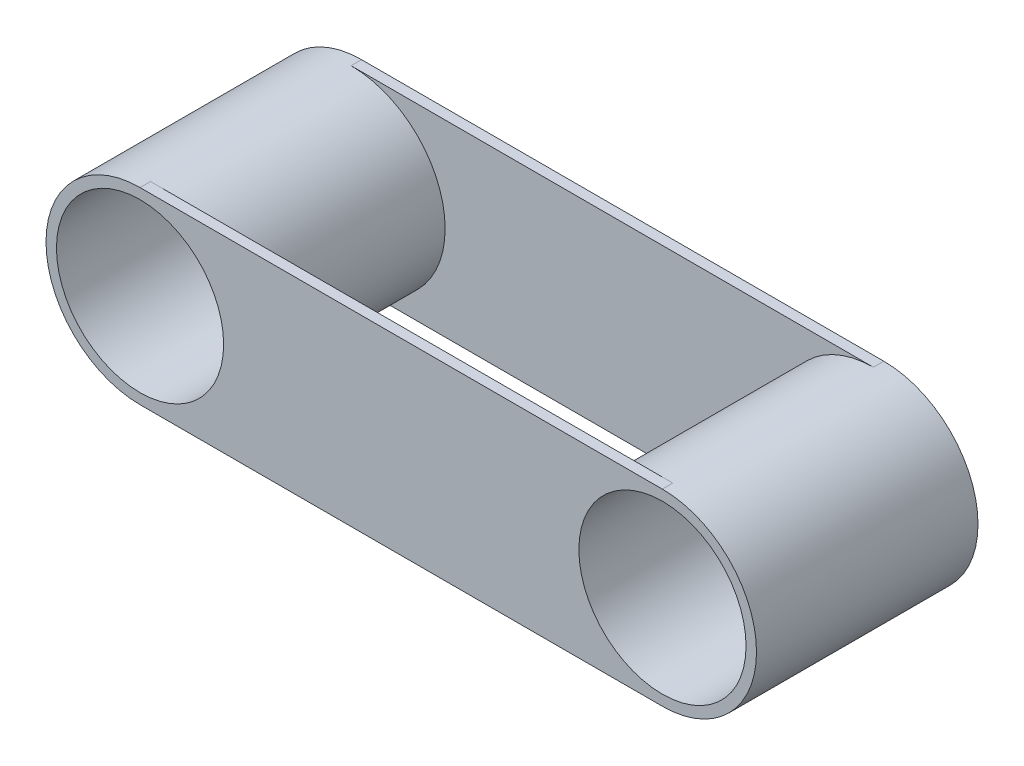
ISO-10303-21;
HEADER;
FILE_DESCRIPTION(('STEP AP214'),'2;1');
FILE_NAME('part.step','',(''),(''),'','','');
FILE_SCHEMA(('AUTOMOTIVE_DESIGN { 1 0 10303 214 1 1 1 1 }'));
ENDSEC;
DATA;
#1=APPLICATION_CONTEXT('core data for automotive mechanical design processes');
#2=APPLICATION_PROTOCOL_DEFINITION('international standard','automotive_design',2000,#1);
#3=PRODUCT_CONTEXT('',#1,'mechanical');
#4=PRODUCT('Part','Part','',(#3));
#5=PRODUCT_RELATED_PRODUCT_CATEGORY('part','',(#4));
#6=PRODUCT_DEFINITION_FORMATION('','',#4);
#7=PRODUCT_DEFINITION_CONTEXT('part definition',#1,'design');
#8=PRODUCT_DEFINITION('design','',#6,#7);
#9=PRODUCT_DEFINITION_SHAPE('','',#8);
#10=(LENGTH_UNIT() NAMED_UNIT(*) SI_UNIT(.MILLI.,.METRE.));
#11=(NAMED_UNIT(*) PLANE_ANGLE_UNIT() SI_UNIT($,.RADIAN.));
#12=(NAMED_UNIT(*) SI_UNIT($,.STERADIAN.) SOLID_ANGLE_UNIT());
#13=UNCERTAINTY_MEASURE_WITH_UNIT(LENGTH_MEASURE(1.E-05),#10,'distance_accuracy_value','');
#14=(GEOMETRIC_REPRESENTATION_CONTEXT(3) GLOBAL_UNCERTAINTY_ASSIGNED_CONTEXT((#13)) GLOBAL_UNIT_ASSIGNED_CONTEXT((#10,
#11,#12)) REPRESENTATION_CONTEXT('',''));
#15=CARTESIAN_POINT('',(0.,0.,0.));
#16=DIRECTION('',(0.,0.,1.));
#17=DIRECTION('',(1.,0.,0.));
#18=AXIS2_PLACEMENT_3D('',#15,#16,#17);
#19=CARTESIAN_POINT('',(499.88,90.,96.));
#20=DIRECTION('',(-1.,0.,0.));
#21=DIRECTION('',(0.,0.,1.));
#22=AXIS2_PLACEMENT_3D('',#19,#20,#21);
#23=PLANE('',#22);
#24=DIRECTION('',(0.,-1.,0.));
#25=VECTOR('',#24,1.);
#26=CARTESIAN_POINT('',(499.88,90.,106.));
#27=LINE('',#26,#25);
#28=CARTESIAN_POINT('',(499.88,90.,106.));
#29=VERTEX_POINT('',#28);
#30=CARTESIAN_POINT('',(499.88,89.9999199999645,106.));
#31=VERTEX_POINT('',#30);
#32=EDGE_CURVE('E60',#29,#31,#27,.T.);
#33=ORIENTED_EDGE('',*,*,#32,.T.);
#34=DIRECTION('',(0.,0.,-1.));
#35=VECTOR('',#34,1.);
#36=CARTESIAN_POINT('',(499.88,89.9999199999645,106.));
#37=LINE('',#36,#35);
#38=CARTESIAN_POINT('',(499.88,89.9999199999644,96.));
#39=VERTEX_POINT('',#38);
#40=EDGE_CURVE('E165',#31,#39,#37,.T.);
#41=ORIENTED_EDGE('',*,*,#40,.T.);
#42=DIRECTION('',(0.,-1.,0.));
#43=VECTOR('',#42,1.);
#44=CARTESIAN_POINT('',(499.88,90.,96.));
#45=LINE('',#44,#43);
#46=CARTESIAN_POINT('',(499.88,90.,96.));
#47=VERTEX_POINT('',#46);
#48=EDGE_CURVE('E183',#47,#39,#45,.T.);
#49=ORIENTED_EDGE('',*,*,#48,.F.);
#50=DIRECTION('',(0.,0.,1.));
#51=VECTOR('',#50,1.);
#52=CARTESIAN_POINT('',(499.88,90.,96.));
#53=LINE('',#52,#51);
#54=EDGE_CURVE('E198',#47,#29,#53,.T.);
#55=ORIENTED_EDGE('',*,*,#54,.T.);
#56=EDGE_LOOP('',(#33,#41,#49,#55));
#57=FACE_BOUND('',#56,.T.);
#58=ADVANCED_FACE('F37',(#57),#23,.F.);
#59=CARTESIAN_POINT('',(499.88,90.,-96.));
#60=DIRECTION('',(1.,0.,0.));
#61=DIRECTION('',(0.,0.,-1.));
#62=AXIS2_PLACEMENT_3D('',#59,#60,#61);
#63=PLANE('',#62);
#64=DIRECTION('',(0.,0.,-1.));
#65=VECTOR('',#64,1.);
#66=CARTESIAN_POINT('',(499.88,-89.9999199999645,106.));
#67=LINE('',#66,#65);
#68=CARTESIAN_POINT('',(499.88,-89.9999199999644,-96.));
#69=VERTEX_POINT('',#68);
#70=CARTESIAN_POINT('',(499.88,-89.9999199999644,-106.));
#71=VERTEX_POINT('',#70);
#72=EDGE_CURVE('E133',#69,#71,#67,.T.);
#73=ORIENTED_EDGE('',*,*,#72,.F.);
#74=DIRECTION('',(0.,-1.,0.));
#75=VECTOR('',#74,1.);
#76=CARTESIAN_POINT('',(499.88,90.,-96.));
#77=LINE('',#76,#75);
#78=CARTESIAN_POINT('',(499.88,-90.,-96.));
#79=VERTEX_POINT('',#78);
#80=EDGE_CURVE('E127',#69,#79,#77,.T.);
#81=ORIENTED_EDGE('',*,*,#80,.T.);
#82=DIRECTION('',(0.,0.,-1.));
#83=VECTOR('',#82,1.);
#84=CARTESIAN_POINT('',(499.88,-90.,-96.));
#85=LINE('',#84,#83);
#86=CARTESIAN_POINT('',(499.88,-90.,-106.));
#87=VERTEX_POINT('',#86);
#88=EDGE_CURVE('E130',#79,#87,#85,.T.);
#89=ORIENTED_EDGE('',*,*,#88,.T.);
#90=DIRECTION('',(0.,-1.,0.));
#91=VECTOR('',#90,1.);
#92=CARTESIAN_POINT('',(499.88,90.,-106.));
#93=LINE('',#92,#91);
#94=EDGE_CURVE('E164',#71,#87,#93,.T.);
#95=ORIENTED_EDGE('',*,*,#94,.F.);
#96=EDGE_LOOP('',(#73,#81,#89,#95));
#97=FACE_BOUND('',#96,.T.);
#98=ADVANCED_FACE('F129',(#97),#63,.T.);
#99=CARTESIAN_POINT('',(0.,0.,106.));
#100=DIRECTION('',(0.,0.,-1.));
#101=DIRECTION('',(-1.,0.,0.));
#102=AXIS2_PLACEMENT_3D('',#99,#100,#101);
#103=CYLINDRICAL_SURFACE('',#102,90.);
#104=CARTESIAN_POINT('',(0.,0.,106.));
#105=DIRECTION('',(0.,0.,1.));
#106=DIRECTION('',(1.,0.,0.));
#107=AXIS2_PLACEMENT_3D('',#104,#105,#106);
#108=CIRCLE('',#107,90.);
#109=CARTESIAN_POINT('',(0.,90.,106.));
#110=VERTEX_POINT('',#109);
#111=CARTESIAN_POINT('',(0.,-90.,106.));
#112=VERTEX_POINT('',#111);
#113=EDGE_CURVE('E45',#110,#112,#108,.T.);
#114=ORIENTED_EDGE('',*,*,#113,.F.);
#115=DIRECTION('',(0.,0.,1.));
#116=VECTOR('',#115,1.);
#117=CARTESIAN_POINT('',(0.,90.,96.));
#118=LINE('',#117,#116);
#119=CARTESIAN_POINT('',(0.,90.,96.));
#120=VERTEX_POINT('',#119);
#121=EDGE_CURVE('E200',#120,#110,#118,.T.);
#122=ORIENTED_EDGE('',*,*,#121,.F.);
#123=CARTESIAN_POINT('',(0.,0.,96.));
#124=DIRECTION('',(0.,0.,1.));
#125=DIRECTION('',(1.,0.,0.));
#126=AXIS2_PLACEMENT_3D('',#123,#124,#125);
#127=CIRCLE('',#126,90.);
#128=CARTESIAN_POINT('',(0.,-90.,96.));
#129=VERTEX_POINT('',#128);
#130=EDGE_CURVE('E176',#129,#120,#127,.T.);
#131=ORIENTED_EDGE('',*,*,#130,.F.);
#132=DIRECTION('',(0.,0.,1.));
#133=VECTOR('',#132,1.);
#134=CARTESIAN_POINT('',(0.,-90.,96.));
#135=LINE('',#134,#133);
#136=EDGE_CURVE('E188',#129,#112,#135,.T.);
#137=ORIENTED_EDGE('',*,*,#136,.T.);
#138=EDGE_LOOP('',(#114,#122,#131,#137));
#139=FACE_BOUND('',#138,.T.);
#140=DIRECTION('',(0.,0.,-1.));
#141=VECTOR('',#140,1.);
#142=CARTESIAN_POINT('',(0.,-90.,-96.));
#143=LINE('',#142,#141);
#144=CARTESIAN_POINT('',(0.,-90.,-96.));
#145=VERTEX_POINT('',#144);
#146=CARTESIAN_POINT('',(0.,-90.,-106.));
#147=VERTEX_POINT('',#146);
#148=EDGE_CURVE('E146',#145,#147,#143,.T.);
#149=ORIENTED_EDGE('',*,*,#148,.F.);
#150=CARTESIAN_POINT('',(0.,0.,-96.));
#151=DIRECTION('',(0.,0.,1.));
#152=DIRECTION('',(1.,0.,0.));
#153=AXIS2_PLACEMENT_3D('',#150,#151,#152);
#154=CIRCLE('',#153,90.);
#155=CARTESIAN_POINT('',(0.,90.,-96.));
#156=VERTEX_POINT('',#155);
#157=EDGE_CURVE('E152',#145,#156,#154,.T.);
#158=ORIENTED_EDGE('',*,*,#157,.T.);
#159=DIRECTION('',(0.,0.,-1.));
#160=VECTOR('',#159,1.);
#161=CARTESIAN_POINT('',(0.,90.,-96.));
#162=LINE('',#161,#160);
#163=CARTESIAN_POINT('',(0.,90.,-106.));
#164=VERTEX_POINT('',#163);
#165=EDGE_CURVE('E162',#156,#164,#162,.T.);
#166=ORIENTED_EDGE('',*,*,#165,.T.);
#167=CARTESIAN_POINT('',(0.,0.,-106.));
#168=DIRECTION('',(0.,0.,1.));
#169=DIRECTION('',(1.,0.,0.));
#170=AXIS2_PLACEMENT_3D('',#167,#168,#169);
#171=CIRCLE('',#170,90.);
#172=EDGE_CURVE('E206',#164,#147,#171,.T.);
#173=ORIENTED_EDGE('',*,*,#172,.T.);
#174=EDGE_LOOP('',(#149,#158,#166,#173));
#175=FACE_BOUND('',#174,.T.);
#176=ADVANCED_FACE('F39',(#139,#175),#103,.T.);
#177=CARTESIAN_POINT('',(0.,0.,106.));
#178=DIRECTION('',(0.,0.,1.));
#179=DIRECTION('',(1.,0.,0.));
#180=AXIS2_PLACEMENT_3D('',#177,#178,#179);
#181=PLANE('',#180);
#182=CARTESIAN_POINT('',(500.,0.,106.));
#183=DIRECTION('',(0.,0.,-1.));
#184=DIRECTION('',(-1.,0.,0.));
#185=AXIS2_PLACEMENT_3D('',#182,#183,#184);
#186=CIRCLE('',#185,80.);
#187=CARTESIAN_POINT('',(420.,0.,106.));
#188=VERTEX_POINT('',#187);
#189=EDGE_CURVE('E240',#188,#188,#186,.T.);
#190=ORIENTED_EDGE('',*,*,#189,.T.);
#191=EDGE_LOOP('',(#190));
#192=FACE_BOUND('',#191,.T.);
#193=CARTESIAN_POINT('',(499.88,-89.9999199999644,106.));
#194=VERTEX_POINT('',#193);
#195=CARTESIAN_POINT('',(499.88,-90.,106.));
#196=VERTEX_POINT('',#195);
#197=EDGE_CURVE('E190',#194,#196,#27,.T.);
#198=ORIENTED_EDGE('',*,*,#197,.F.);
#199=CARTESIAN_POINT('',(500.,0.,106.));
#200=DIRECTION('',(0.,0.,-1.));
#201=DIRECTION('',(-1.,0.,0.));
#202=AXIS2_PLACEMENT_3D('',#199,#200,#201);
#203=CIRCLE('',#202,90.);
#204=EDGE_CURVE('E227',#31,#194,#203,.T.);
#205=ORIENTED_EDGE('',*,*,#204,.F.);
#206=ORIENTED_EDGE('',*,*,#32,.F.);
#207=DIRECTION('',(1.,0.,0.));
#208=VECTOR('',#207,1.);
#209=CARTESIAN_POINT('',(0.,90.,106.));
#210=LINE('',#209,#208);
#211=EDGE_CURVE('E175',#110,#29,#210,.T.);
#212=ORIENTED_EDGE('',*,*,#211,.F.);
#213=ORIENTED_EDGE('',*,*,#113,.T.);
#214=DIRECTION('',(-1.,0.,0.));
#215=VECTOR('',#214,1.);
#216=CARTESIAN_POINT('',(499.88,-90.,106.));
#217=LINE('',#216,#215);
#218=EDGE_CURVE('E180',#196,#112,#217,.T.);
#219=ORIENTED_EDGE('',*,*,#218,.F.);
#220=EDGE_LOOP('',(#198,#205,#206,#212,#213,#219));
#221=FACE_BOUND('',#220,.T.);
#222=CARTESIAN_POINT('',(0.,0.,106.));
#223=DIRECTION('',(0.,0.,1.));
#224=DIRECTION('',(1.,0.,0.));
#225=AXIS2_PLACEMENT_3D('',#222,#223,#224);
#226=CIRCLE('',#225,80.);
#227=CARTESIAN_POINT('',(80.,0.,106.));
#228=VERTEX_POINT('',#227);
#229=EDGE_CURVE('E203',#228,#228,#226,.T.);
#230=ORIENTED_EDGE('',*,*,#229,.F.);
#231=EDGE_LOOP('',(#230));
#232=FACE_BOUND('',#231,.T.);
#233=ADVANCED_FACE('F248',(#192,#221,#232),#181,.T.);
#234=CARTESIAN_POINT('',(0.,0.,-106.));
#235=DIRECTION('',(0.,0.,1.));
#236=DIRECTION('',(1.,0.,0.));
#237=AXIS2_PLACEMENT_3D('',#234,#235,#236);
#238=PLANE('',#237);
#239=CARTESIAN_POINT('',(499.88,90.,-106.));
#240=VERTEX_POINT('',#239);
#241=CARTESIAN_POINT('',(499.88,89.9999199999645,-106.));
#242=VERTEX_POINT('',#241);
#243=EDGE_CURVE('E166',#240,#242,#93,.T.);
#244=ORIENTED_EDGE('',*,*,#243,.T.);
#245=CARTESIAN_POINT('',(500.,0.,-106.));
#246=DIRECTION('',(0.,0.,-1.));
#247=DIRECTION('',(-1.,0.,0.));
#248=AXIS2_PLACEMENT_3D('',#245,#246,#247);
#249=CIRCLE('',#248,90.);
#250=EDGE_CURVE('E218',#242,#71,#249,.T.);
#251=ORIENTED_EDGE('',*,*,#250,.T.);
#252=ORIENTED_EDGE('',*,*,#94,.T.);
#253=DIRECTION('',(-1.,0.,0.));
#254=VECTOR('',#253,1.);
#255=CARTESIAN_POINT('',(499.88,-90.,-106.));
#256=LINE('',#255,#254);
#257=EDGE_CURVE('E145',#87,#147,#256,.T.);
#258=ORIENTED_EDGE('',*,*,#257,.T.);
#259=ORIENTED_EDGE('',*,*,#172,.F.);
#260=DIRECTION('',(1.,0.,0.));
#261=VECTOR('',#260,1.);
#262=CARTESIAN_POINT('',(0.,90.,-106.));
#263=LINE('',#262,#261);
#264=EDGE_CURVE('E154',#164,#240,#263,.T.);
#265=ORIENTED_EDGE('',*,*,#264,.T.);
#266=EDGE_LOOP('',(#244,#251,#252,#258,#259,#265));
#267=FACE_BOUND('',#266,.T.);
#268=CARTESIAN_POINT('',(0.,0.,-106.));
#269=DIRECTION('',(0.,0.,1.));
#270=DIRECTION('',(1.,0.,0.));
#271=AXIS2_PLACEMENT_3D('',#268,#269,#270);
#272=CIRCLE('',#271,80.);
#273=CARTESIAN_POINT('',(80.,0.,-106.));
#274=VERTEX_POINT('',#273);
#275=EDGE_CURVE('E202',#274,#274,#272,.T.);
#276=ORIENTED_EDGE('',*,*,#275,.T.);
#277=EDGE_LOOP('',(#276));
#278=FACE_BOUND('',#277,.T.);
#279=CARTESIAN_POINT('',(500.,0.,-106.));
#280=DIRECTION('',(0.,0.,-1.));
#281=DIRECTION('',(-1.,0.,0.));
#282=AXIS2_PLACEMENT_3D('',#279,#280,#281);
#283=CIRCLE('',#282,80.);
#284=CARTESIAN_POINT('',(420.,0.,-106.));
#285=VERTEX_POINT('',#284);
#286=EDGE_CURVE('E242',#285,#285,#283,.T.);
#287=ORIENTED_EDGE('',*,*,#286,.F.);
#288=EDGE_LOOP('',(#287));
#289=FACE_BOUND('',#288,.T.);
#290=ADVANCED_FACE('F214',(#267,#278,#289),#238,.F.);
#291=CARTESIAN_POINT('',(0.,0.,106.));
#292=DIRECTION('',(0.,0.,-1.));
#293=DIRECTION('',(-1.,0.,0.));
#294=AXIS2_PLACEMENT_3D('',#291,#292,#293);
#295=CYLINDRICAL_SURFACE('',#294,80.);
#296=ORIENTED_EDGE('',*,*,#229,.T.);
#297=EDGE_LOOP('',(#296));
#298=FACE_BOUND('',#297,.T.);
#299=ORIENTED_EDGE('',*,*,#275,.F.);
#300=EDGE_LOOP('',(#299));
#301=FACE_BOUND('',#300,.T.);
#302=ADVANCED_FACE('F276',(#298,#301),#295,.F.);
#303=CARTESIAN_POINT('',(0.,90.,96.));
#304=DIRECTION('',(0.,-1.,0.));
#305=DIRECTION('',(0.,0.,-1.));
#306=AXIS2_PLACEMENT_3D('',#303,#304,#305);
#307=PLANE('',#306);
#308=ORIENTED_EDGE('',*,*,#211,.T.);
#309=ORIENTED_EDGE('',*,*,#54,.F.);
#310=DIRECTION('',(1.,0.,0.));
#311=VECTOR('',#310,1.);
#312=CARTESIAN_POINT('',(0.,90.,96.));
#313=LINE('',#312,#311);
#314=EDGE_CURVE('E179',#120,#47,#313,.T.);
#315=ORIENTED_EDGE('',*,*,#314,.F.);
#316=ORIENTED_EDGE('',*,*,#121,.T.);
#317=EDGE_LOOP('',(#308,#309,#315,#316));
#318=FACE_BOUND('',#317,.T.);
#319=ADVANCED_FACE('F270',(#318),#307,.F.);
#320=CARTESIAN_POINT('',(499.88,-89.9999199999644,96.));
#321=VERTEX_POINT('',#320);
#322=CARTESIAN_POINT('',(499.88,-90.,96.));
#323=VERTEX_POINT('',#322);
#324=EDGE_CURVE('E182',#321,#323,#45,.T.);
#325=ORIENTED_EDGE('',*,*,#324,.F.);
#326=DIRECTION('',(0.,0.,-1.));
#327=VECTOR('',#326,1.);
#328=CARTESIAN_POINT('',(499.88,-89.9999199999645,106.));
#329=LINE('',#328,#327);
#330=EDGE_CURVE('E52',#321,#194,#329,.F.);
#331=ORIENTED_EDGE('',*,*,#330,.T.);
#332=ORIENTED_EDGE('',*,*,#197,.T.);
#333=DIRECTION('',(0.,0.,1.));
#334=VECTOR('',#333,1.);
#335=CARTESIAN_POINT('',(499.88,-90.,96.));
#336=LINE('',#335,#334);
#337=EDGE_CURVE('E195',#323,#196,#336,.T.);
#338=ORIENTED_EDGE('',*,*,#337,.F.);
#339=EDGE_LOOP('',(#325,#331,#332,#338));
#340=FACE_BOUND('',#339,.T.);
#341=ADVANCED_FACE('F260',(#340),#23,.F.);
#342=CARTESIAN_POINT('',(499.88,-90.,96.));
#343=DIRECTION('',(0.,1.,0.));
#344=DIRECTION('',(-1.,0.,0.));
#345=AXIS2_PLACEMENT_3D('',#342,#343,#344);
#346=PLANE('',#345);
#347=ORIENTED_EDGE('',*,*,#218,.T.);
#348=ORIENTED_EDGE('',*,*,#136,.F.);
#349=DIRECTION('',(-1.,0.,0.));
#350=VECTOR('',#349,1.);
#351=CARTESIAN_POINT('',(499.88,-90.,96.));
#352=LINE('',#351,#350);
#353=EDGE_CURVE('E186',#323,#129,#352,.T.);
#354=ORIENTED_EDGE('',*,*,#353,.F.);
#355=ORIENTED_EDGE('',*,*,#337,.T.);
#356=EDGE_LOOP('',(#347,#348,#354,#355));
#357=FACE_BOUND('',#356,.T.);
#358=ADVANCED_FACE('F269',(#357),#346,.F.);
#359=CARTESIAN_POINT('',(0.,0.,96.));
#360=DIRECTION('',(0.,0.,1.));
#361=DIRECTION('',(1.,0.,0.));
#362=AXIS2_PLACEMENT_3D('',#359,#360,#361);
#363=PLANE('',#362);
#364=ORIENTED_EDGE('',*,*,#48,.T.);
#365=CARTESIAN_POINT('',(500.,0.,96.));
#366=DIRECTION('',(0.,0.,1.));
#367=DIRECTION('',(1.,0.,0.));
#368=AXIS2_PLACEMENT_3D('',#365,#366,#367);
#369=CIRCLE('',#368,90.);
#370=EDGE_CURVE('E223',#39,#321,#369,.T.);
#371=ORIENTED_EDGE('',*,*,#370,.T.);
#372=ORIENTED_EDGE('',*,*,#324,.T.);
#373=ORIENTED_EDGE('',*,*,#353,.T.);
#374=ORIENTED_EDGE('',*,*,#130,.T.);
#375=ORIENTED_EDGE('',*,*,#314,.T.);
#376=EDGE_LOOP('',(#364,#371,#372,#373,#374,#375));
#377=FACE_BOUND('',#376,.T.);
#378=ADVANCED_FACE('F236',(#377),#363,.F.);
#379=CARTESIAN_POINT('',(499.88,-90.,-96.));
#380=DIRECTION('',(0.,-1.,0.));
#381=DIRECTION('',(1.,0.,0.));
#382=AXIS2_PLACEMENT_3D('',#379,#380,#381);
#383=PLANE('',#382);
#384=ORIENTED_EDGE('',*,*,#257,.F.);
#385=ORIENTED_EDGE('',*,*,#88,.F.);
#386=DIRECTION('',(-1.,0.,0.));
#387=VECTOR('',#386,1.);
#388=CARTESIAN_POINT('',(499.88,-90.,-96.));
#389=LINE('',#388,#387);
#390=EDGE_CURVE('E138',#79,#145,#389,.T.);
#391=ORIENTED_EDGE('',*,*,#390,.T.);
#392=ORIENTED_EDGE('',*,*,#148,.T.);
#393=EDGE_LOOP('',(#384,#385,#391,#392));
#394=FACE_BOUND('',#393,.T.);
#395=ADVANCED_FACE('F142',(#394),#383,.T.);
#396=DIRECTION('',(0.,0.,-1.));
#397=VECTOR('',#396,1.);
#398=CARTESIAN_POINT('',(499.88,89.9999199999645,106.));
#399=LINE('',#398,#397);
#400=CARTESIAN_POINT('',(499.88,89.9999199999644,-96.));
#401=VERTEX_POINT('',#400);
#402=EDGE_CURVE('E224',#242,#401,#399,.F.);
#403=ORIENTED_EDGE('',*,*,#402,.F.);
#404=ORIENTED_EDGE('',*,*,#243,.F.);
#405=DIRECTION('',(0.,0.,-1.));
#406=VECTOR('',#405,1.);
#407=CARTESIAN_POINT('',(499.88,90.,-96.));
#408=LINE('',#407,#406);
#409=CARTESIAN_POINT('',(499.88,90.,-96.));
#410=VERTEX_POINT('',#409);
#411=EDGE_CURVE('E147',#410,#240,#408,.T.);
#412=ORIENTED_EDGE('',*,*,#411,.F.);
#413=EDGE_CURVE('E137',#410,#401,#77,.T.);
#414=ORIENTED_EDGE('',*,*,#413,.T.);
#415=EDGE_LOOP('',(#403,#404,#412,#414));
#416=FACE_BOUND('',#415,.T.);
#417=ADVANCED_FACE('F265',(#416),#63,.T.);
#418=CARTESIAN_POINT('',(0.,90.,-96.));
#419=DIRECTION('',(0.,1.,0.));
#420=DIRECTION('',(0.,0.,1.));
#421=AXIS2_PLACEMENT_3D('',#418,#419,#420);
#422=PLANE('',#421);
#423=ORIENTED_EDGE('',*,*,#264,.F.);
#424=ORIENTED_EDGE('',*,*,#165,.F.);
#425=DIRECTION('',(1.,0.,0.));
#426=VECTOR('',#425,1.);
#427=CARTESIAN_POINT('',(0.,90.,-96.));
#428=LINE('',#427,#426);
#429=EDGE_CURVE('E159',#156,#410,#428,.T.);
#430=ORIENTED_EDGE('',*,*,#429,.T.);
#431=ORIENTED_EDGE('',*,*,#411,.T.);
#432=EDGE_LOOP('',(#423,#424,#430,#431));
#433=FACE_BOUND('',#432,.T.);
#434=ADVANCED_FACE('F344',(#433),#422,.T.);
#435=CARTESIAN_POINT('',(0.,0.,-96.));
#436=DIRECTION('',(0.,0.,-1.));
#437=DIRECTION('',(1.,0.,0.));
#438=AXIS2_PLACEMENT_3D('',#435,#436,#437);
#439=PLANE('',#438);
#440=ORIENTED_EDGE('',*,*,#80,.F.);
#441=CARTESIAN_POINT('',(500.,0.,-96.));
#442=DIRECTION('',(0.,0.,-1.));
#443=DIRECTION('',(-1.,0.,0.));
#444=AXIS2_PLACEMENT_3D('',#441,#442,#443);
#445=CIRCLE('',#444,90.);
#446=EDGE_CURVE('E11',#69,#401,#445,.T.);
#447=ORIENTED_EDGE('',*,*,#446,.T.);
#448=ORIENTED_EDGE('',*,*,#413,.F.);
#449=ORIENTED_EDGE('',*,*,#429,.F.);
#450=ORIENTED_EDGE('',*,*,#157,.F.);
#451=ORIENTED_EDGE('',*,*,#390,.F.);
#452=EDGE_LOOP('',(#440,#447,#448,#449,#450,#451));
#453=FACE_BOUND('',#452,.T.);
#454=ADVANCED_FACE('F150',(#453),#439,.F.);
#455=CARTESIAN_POINT('',(500.,0.,106.));
#456=DIRECTION('',(0.,0.,-1.));
#457=DIRECTION('',(-1.,0.,0.));
#458=AXIS2_PLACEMENT_3D('',#455,#456,#457);
#459=CYLINDRICAL_SURFACE('',#458,90.);
#460=ORIENTED_EDGE('',*,*,#446,.F.);
#461=ORIENTED_EDGE('',*,*,#72,.T.);
#462=ORIENTED_EDGE('',*,*,#250,.F.);
#463=ORIENTED_EDGE('',*,*,#402,.T.);
#464=EDGE_LOOP('',(#460,#461,#462,#463));
#465=FACE_BOUND('',#464,.T.);
#466=ORIENTED_EDGE('',*,*,#40,.F.);
#467=ORIENTED_EDGE('',*,*,#204,.T.);
#468=ORIENTED_EDGE('',*,*,#330,.F.);
#469=ORIENTED_EDGE('',*,*,#370,.F.);
#470=EDGE_LOOP('',(#466,#467,#468,#469));
#471=FACE_BOUND('',#470,.T.);
#472=ADVANCED_FACE('F220',(#465,#471),#459,.T.);
#473=CARTESIAN_POINT('',(500.,0.,106.));
#474=DIRECTION('',(0.,0.,-1.));
#475=DIRECTION('',(-1.,0.,0.));
#476=AXIS2_PLACEMENT_3D('',#473,#474,#475);
#477=CYLINDRICAL_SURFACE('',#476,80.);
#478=ORIENTED_EDGE('',*,*,#286,.T.);
#479=EDGE_LOOP('',(#478));
#480=FACE_BOUND('',#479,.T.);
#481=ORIENTED_EDGE('',*,*,#189,.F.);
#482=EDGE_LOOP('',(#481));
#483=FACE_BOUND('',#482,.T.);
#484=ADVANCED_FACE('F250',(#480,#483),#477,.F.);
#485=CLOSED_SHELL('',(#58,#98,#176,#233,#290,#302,#319,#341,#358,#378,#395,#417,#434,#454,#472,#484));
#486=MANIFOLD_SOLID_BREP('B2',#485);
#487=ADVANCED_BREP_SHAPE_REPRESENTATION('',(#18,#486),#14);
#488=SHAPE_DEFINITION_REPRESENTATION(#9,#487);
ENDSEC;
END-ISO-10303-21;
